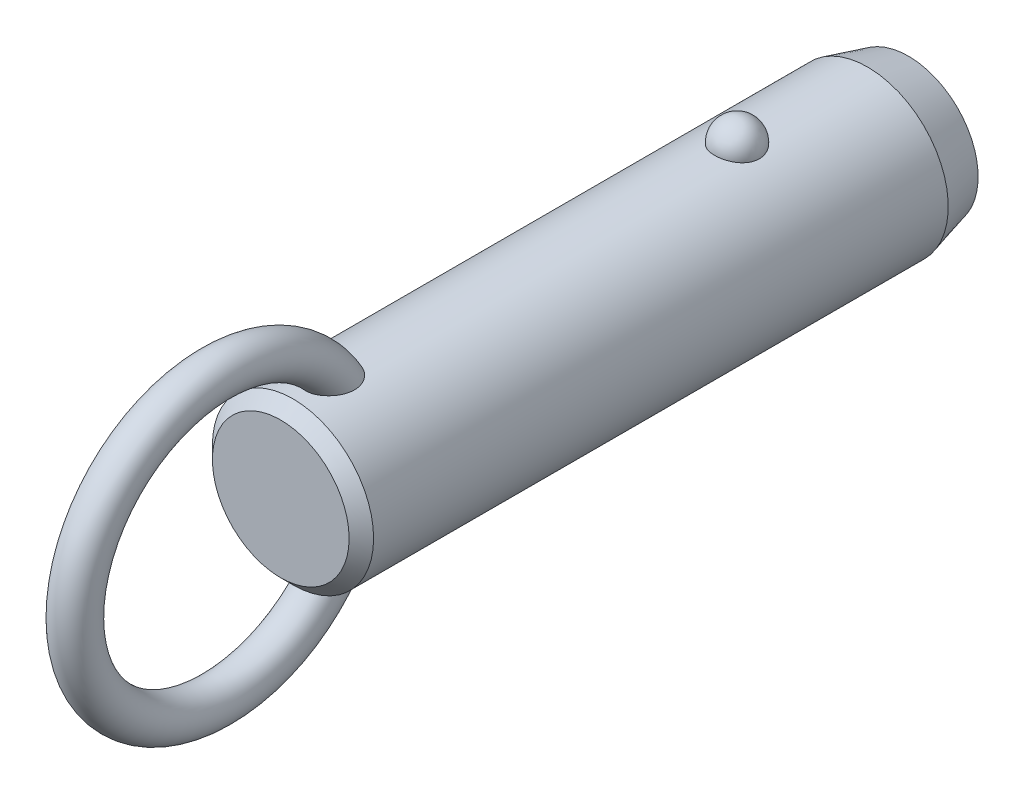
ISO-10303-21;
HEADER;
FILE_DESCRIPTION(('STEP AP214'),'2;1');
FILE_NAME('part.step','',(''),(''),'','','');
FILE_SCHEMA(('AUTOMOTIVE_DESIGN { 1 0 10303 214 1 1 1 1 }'));
ENDSEC;
DATA;
#1=APPLICATION_CONTEXT('core data for automotive mechanical design processes');
#2=APPLICATION_PROTOCOL_DEFINITION('international standard','automotive_design',2000,#1);
#3=PRODUCT_CONTEXT('',#1,'mechanical');
#4=PRODUCT('Part','Part','',(#3));
#5=PRODUCT_RELATED_PRODUCT_CATEGORY('part','',(#4));
#6=PRODUCT_DEFINITION_FORMATION('','',#4);
#7=PRODUCT_DEFINITION_CONTEXT('part definition',#1,'design');
#8=PRODUCT_DEFINITION('design','',#6,#7);
#9=PRODUCT_DEFINITION_SHAPE('','',#8);
#10=(LENGTH_UNIT() NAMED_UNIT(*) SI_UNIT(.MILLI.,.METRE.));
#11=(NAMED_UNIT(*) PLANE_ANGLE_UNIT() SI_UNIT($,.RADIAN.));
#12=(NAMED_UNIT(*) SI_UNIT($,.STERADIAN.) SOLID_ANGLE_UNIT());
#13=UNCERTAINTY_MEASURE_WITH_UNIT(LENGTH_MEASURE(1.E-05),#10,'distance_accuracy_value','');
#14=(GEOMETRIC_REPRESENTATION_CONTEXT(3) GLOBAL_UNCERTAINTY_ASSIGNED_CONTEXT((#13)) GLOBAL_UNIT_ASSIGNED_CONTEXT((#10,
#11,#12)) REPRESENTATION_CONTEXT('',''));
#15=CARTESIAN_POINT('',(0.,0.,0.));
#16=DIRECTION('',(0.,0.,1.));
#17=DIRECTION('',(1.,0.,0.));
#18=AXIS2_PLACEMENT_3D('',#15,#16,#17);
#19=CARTESIAN_POINT('',(0.,0.,33.));
#20=DIRECTION('',(0.,0.,-1.));
#21=DIRECTION('',(-1.,0.,0.));
#22=AXIS2_PLACEMENT_3D('',#19,#20,#21);
#23=CYLINDRICAL_SURFACE('',#22,7.9);
#24=CARTESIAN_POINT('',(2.1785689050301,7.59367088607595,-2.20000000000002));
#25=CARTESIAN_POINT('',(2.17856679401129,7.59367269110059,-2.07701843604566));
#26=CARTESIAN_POINT('',(2.16853481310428,7.59657145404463,-1.95401006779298));
#27=CARTESIAN_POINT('',(2.12864689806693,7.607843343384,-1.71147811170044));
#28=CARTESIAN_POINT('',(2.09878338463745,7.61621856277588,-1.5919558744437));
#29=CARTESIAN_POINT('',(2.0199931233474,7.63749180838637,-1.35985638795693));
#30=CARTESIAN_POINT('',(1.97107475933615,7.6503878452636,-1.24727610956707));
#31=CARTESIAN_POINT('',(1.85539377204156,7.67926115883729,-1.03213234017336));
#32=CARTESIAN_POINT('',(1.78863158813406,7.69523835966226,-0.929568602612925));
#33=CARTESIAN_POINT('',(1.63856494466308,7.7285848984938,-0.73678633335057));
#34=CARTESIAN_POINT('',(1.55518140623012,7.7459606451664,-0.646630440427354));
#35=CARTESIAN_POINT('',(1.37422937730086,7.78009978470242,-0.481747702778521));
#36=CARTESIAN_POINT('',(1.27666086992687,7.79686317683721,-0.407020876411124));
#37=CARTESIAN_POINT('',(1.07024728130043,7.82786153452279,-0.275278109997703));
#38=CARTESIAN_POINT('',(0.961434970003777,7.84210353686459,-0.218212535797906));
#39=CARTESIAN_POINT('',(0.735351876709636,7.86652194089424,-0.123146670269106));
#40=CARTESIAN_POINT('',(0.618082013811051,7.87669878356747,-0.0851443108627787));
#41=CARTESIAN_POINT('',(0.380637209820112,7.89170521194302,-0.0298158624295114));
#42=CARTESIAN_POINT('',(0.260550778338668,7.89662650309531,-0.0121347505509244));
#43=CARTESIAN_POINT('',(0.0190117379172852,7.90090003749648,0.00324379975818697));
#44=CARTESIAN_POINT('',(-0.102440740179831,7.90025280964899,0.000943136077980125));
#45=CARTESIAN_POINT('',(-0.341452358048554,7.89351056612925,-0.0233955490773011));
#46=CARTESIAN_POINT('',(-0.459042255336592,7.88749257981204,-0.0451545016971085));
#47=CARTESIAN_POINT('',(-0.688796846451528,7.87075812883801,-0.107408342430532));
#48=CARTESIAN_POINT('',(-0.800961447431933,7.86004158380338,-0.14790355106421));
#49=CARTESIAN_POINT('',(-1.01743634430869,7.83497131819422,-0.246799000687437));
#50=CARTESIAN_POINT('',(-1.12169791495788,7.82059709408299,-0.305300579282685));
#51=CARTESIAN_POINT('',(-1.31891765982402,7.78976470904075,-0.43854939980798));
#52=CARTESIAN_POINT('',(-1.41187469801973,7.77330633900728,-0.513298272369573));
#53=CARTESIAN_POINT('',(-1.58577142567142,7.73972434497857,-0.678622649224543));
#54=CARTESIAN_POINT('',(-1.66645140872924,7.72259402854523,-0.769470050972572));
#55=CARTESIAN_POINT('',(-1.81161503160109,7.68983776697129,-0.963538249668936));
#56=CARTESIAN_POINT('',(-1.87609753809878,7.6742119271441,-1.0667599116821));
#57=CARTESIAN_POINT('',(-1.98790138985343,7.6460202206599,-1.28401170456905));
#58=CARTESIAN_POINT('',(-2.03501994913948,7.63349104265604,-1.39815107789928));
#59=CARTESIAN_POINT('',(-2.10986724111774,7.6131449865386,-1.6330178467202));
#60=CARTESIAN_POINT('',(-2.1375965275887,7.60532797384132,-1.75374505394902));
#61=CARTESIAN_POINT('',(-2.17289256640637,7.5953195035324,-1.99782562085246));
#62=CARTESIAN_POINT('',(-2.18054294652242,7.59310471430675,-2.12116592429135));
#63=CARTESIAN_POINT('',(-2.17572919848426,7.59448538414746,-2.36741799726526));
#64=CARTESIAN_POINT('',(-2.1632656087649,7.59808068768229,-2.49032977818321));
#65=CARTESIAN_POINT('',(-2.11865035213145,7.61064035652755,-2.73161015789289));
#66=CARTESIAN_POINT('',(-2.08659579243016,7.61957823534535,-2.84999812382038));
#67=CARTESIAN_POINT('',(-2.00367799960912,7.64179982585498,-3.07955956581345));
#68=CARTESIAN_POINT('',(-1.9528140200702,7.65508371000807,-3.19073275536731));
#69=CARTESIAN_POINT('',(-1.83321113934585,7.68460381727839,-3.40337899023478));
#70=CARTESIAN_POINT('',(-1.76437735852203,7.70085556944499,-3.5047965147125));
#71=CARTESIAN_POINT('',(-1.61069526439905,7.73445734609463,-3.69446912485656));
#72=CARTESIAN_POINT('',(-1.52584634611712,7.75180741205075,-3.78272371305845));
#73=CARTESIAN_POINT('',(-1.34198059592,7.78574608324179,-3.94393987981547));
#74=CARTESIAN_POINT('',(-1.24291308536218,7.80233167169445,-4.01684434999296));
#75=CARTESIAN_POINT('',(-1.03352039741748,7.83281625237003,-4.14489386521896));
#76=CARTESIAN_POINT('',(-0.92319600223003,7.84671543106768,-4.20004014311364));
#77=CARTESIAN_POINT('',(-0.695822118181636,7.87011575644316,-4.29042017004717));
#78=CARTESIAN_POINT('',(-0.578872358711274,7.87966903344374,-4.32589112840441));
#79=CARTESIAN_POINT('',(-0.340410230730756,7.8935652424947,-4.37692226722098));
#80=CARTESIAN_POINT('',(-0.218898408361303,7.89790879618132,-4.39248482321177));
#81=CARTESIAN_POINT('',(0.0228107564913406,7.90087453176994,-4.40314405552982));
#82=CARTESIAN_POINT('',(0.142990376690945,7.89960185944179,-4.39861683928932));
#83=CARTESIAN_POINT('',(0.380829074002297,7.89171262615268,-4.37008293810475));
#84=CARTESIAN_POINT('',(0.498488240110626,7.8850962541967,-4.34607694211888));
#85=CARTESIAN_POINT('',(0.727535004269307,7.86726442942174,-4.27939317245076));
#86=CARTESIAN_POINT('',(0.838944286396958,7.85606616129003,-4.23678512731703));
#87=CARTESIAN_POINT('',(1.05295421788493,7.83025654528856,-4.13408348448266));
#88=CARTESIAN_POINT('',(1.15555431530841,7.81564498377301,-4.07398879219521));
#89=CARTESIAN_POINT('',(1.35076763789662,7.7843022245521,-3.93687432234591));
#90=CARTESIAN_POINT('',(1.4432046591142,7.76754209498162,-3.85961036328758));
#91=CARTESIAN_POINT('',(1.6139111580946,7.73387857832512,-3.69076949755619));
#92=CARTESIAN_POINT('',(1.6921781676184,7.71697516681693,-3.59919010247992));
#93=CARTESIAN_POINT('',(1.83380875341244,7.6845643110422,-3.40247278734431));
#94=CARTESIAN_POINT('',(1.89689280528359,7.66908588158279,-3.29712873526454));
#95=CARTESIAN_POINT('',(2.0047823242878,7.64159441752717,-3.07707931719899));
#96=CARTESIAN_POINT('',(2.0495945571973,7.62958010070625,-2.96237743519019));
#97=CARTESIAN_POINT('',(2.11580183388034,7.61146617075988,-2.74040519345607));
#98=CARTESIAN_POINT('',(2.13929812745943,7.60484503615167,-2.63379846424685));
#99=CARTESIAN_POINT('',(2.17068242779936,7.59594664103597,-2.4181348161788));
#100=CARTESIAN_POINT('',(2.17857077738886,7.59366928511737,-2.30907795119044));
#101=CARTESIAN_POINT('',(2.1785689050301,7.59367088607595,-2.20000000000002));
#102=B_SPLINE_CURVE_WITH_KNOTS('',3,(#24,#25,#26,#27,#28,#29,#30,#31,#32,#33,#34,#35,#36,#37,
#38,#39,#40,#41,#42,#43,#44,#45,#46,#47,#48,#49,#50,#51,#52,#53,#54,#55,#56,#57,#58,#59,#60,#61,
#62,#63,#64,#65,#66,#67,#68,#69,#70,#71,#72,#73,#74,#75,#76,#77,#78,#79,#80,#81,#82,#83,#84,#85,
#86,#87,#88,#89,#90,#91,#92,#93,#94,#95,#96,#97,#98,#99,#100,#101),.UNSPECIFIED.,.T.,.F.,(4,2,2,
2,2,2,2,2,2,2,2,2,2,2,2,2,2,2,2,2,2,2,2,2,2,2,2,2,2,2,2,2,2,2,2,2,2,2,4),(0.,0.368552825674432,
0.737246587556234,1.10577831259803,1.4743009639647,1.8446206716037,2.21494081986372,
2.5842105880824,2.95344028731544,3.31611630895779,3.67875788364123,4.03628044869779,
4.39380913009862,4.75338791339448,5.11300280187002,5.47939989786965,5.8458226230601,
6.21639834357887,6.58696347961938,6.95598276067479,7.32499216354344,7.69218715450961,
8.0593967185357,8.42858578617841,8.79778880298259,9.16834203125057,9.5388695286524,
9.90482699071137,10.2707407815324,10.6298333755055,10.9889132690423,11.3466585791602,
11.7044262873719,12.0676511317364,12.4309391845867,12.8004764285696,13.1698767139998,
13.4967701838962,13.8236564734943),.UNSPECIFIED.);
#103=CARTESIAN_POINT('',(2.1785689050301,7.59367088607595,-2.20000000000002));
#104=VERTEX_POINT('',#103);
#105=EDGE_CURVE('E41',#104,#104,#102,.T.);
#106=ORIENTED_EDGE('',*,*,#105,.T.);
#107=EDGE_LOOP('',(#106));
#108=FACE_BOUND('',#107,.T.);
#109=CARTESIAN_POINT('',(0.,0.,41.32));
#110=DIRECTION('',(0.,0.,1.));
#111=DIRECTION('',(1.,0.,0.));
#112=AXIS2_PLACEMENT_3D('',#109,#110,#111);
#113=CIRCLE('',#112,7.9);
#114=CARTESIAN_POINT('',(7.9,0.,41.32));
#115=VERTEX_POINT('',#114);
#116=EDGE_CURVE('E10',#115,#115,#113,.F.);
#117=ORIENTED_EDGE('',*,*,#116,.T.);
#118=EDGE_LOOP('',(#117));
#119=FACE_BOUND('',#118,.T.);
#120=CARTESIAN_POINT('',(-0.630969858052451,-7.87476203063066,35.2124322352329));
#121=CARTESIAN_POINT('',(-0.734180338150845,-7.86648998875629,35.2472854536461));
#122=CARTESIAN_POINT('',(-0.834476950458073,-7.85639291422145,35.2908160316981));
#123=CARTESIAN_POINT('',(-1.0262035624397,-7.83366343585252,35.3940948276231));
#124=CARTESIAN_POINT('',(-1.1176141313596,-7.82102565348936,35.4538775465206));
#125=CARTESIAN_POINT('',(-1.28877277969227,-7.79464922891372,35.5878390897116));
#126=CARTESIAN_POINT('',(-1.36854014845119,-7.78091246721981,35.661993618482));
#127=CARTESIAN_POINT('',(-1.51461521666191,-7.75380398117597,35.8224941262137));
#128=CARTESIAN_POINT('',(-1.58092966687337,-7.74043207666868,35.9088339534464));
#129=CARTESIAN_POINT('',(-1.70019064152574,-7.7151252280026,36.0929784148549));
#130=CARTESIAN_POINT('',(-1.75284037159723,-7.70322473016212,36.1909792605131));
#131=CARTESIAN_POINT('',(-1.84263464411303,-7.68224112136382,36.3941029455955));
#132=CARTESIAN_POINT('',(-1.87977299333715,-7.6731591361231,36.4992286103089));
#133=CARTESIAN_POINT('',(-1.94152728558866,-7.65777930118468,36.7232849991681));
#134=CARTESIAN_POINT('',(-1.96475471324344,-7.65179654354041,36.8426167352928));
#135=CARTESIAN_POINT('',(-1.99449499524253,-7.64409642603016,37.0834298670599));
#136=CARTESIAN_POINT('',(-2.0010005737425,-7.64238092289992,37.2049121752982));
#137=CARTESIAN_POINT('',(-1.99856014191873,-7.64302120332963,37.4683409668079));
#138=CARTESIAN_POINT('',(-1.98680021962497,-7.64611845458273,37.6102565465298));
#139=CARTESIAN_POINT('',(-1.94457772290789,-7.65696186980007,37.8911188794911));
#140=CARTESIAN_POINT('',(-1.91409393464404,-7.66471330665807,38.0300620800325));
#141=CARTESIAN_POINT('',(-1.82768670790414,-7.68582947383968,38.331939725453));
#142=CARTESIAN_POINT('',(-1.76772963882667,-7.70003779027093,38.493686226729));
#143=CARTESIAN_POINT('',(-1.65998501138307,-7.72371550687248,38.7276956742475));
#144=CARTESIAN_POINT('',(-1.62107967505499,-7.73200670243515,38.8042974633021));
#145=CARTESIAN_POINT('',(-1.53727726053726,-7.74910377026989,38.9540798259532));
#146=CARTESIAN_POINT('',(-1.4923821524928,-7.75790947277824,39.0272615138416));
#147=CARTESIAN_POINT('',(-1.37397050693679,-7.77993338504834,39.2028838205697));
#148=CARTESIAN_POINT('',(-1.29690364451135,-7.79328473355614,39.3029557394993));
#149=CARTESIAN_POINT('',(-1.12885487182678,-7.81939266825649,39.4907147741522));
#150=CARTESIAN_POINT('',(-1.03789926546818,-7.83215032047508,39.5784247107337));
#151=CARTESIAN_POINT('',(-0.869532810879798,-7.85231710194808,39.7134148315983));
#152=CARTESIAN_POINT('',(-0.795716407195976,-7.86021093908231,39.765076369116));
#153=CARTESIAN_POINT('',(-0.640813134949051,-7.87434920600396,39.8563815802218));
#154=CARTESIAN_POINT('',(-0.559737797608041,-7.88059619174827,39.8960438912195));
#155=CARTESIAN_POINT('',(-0.406456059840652,-7.88984116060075,39.9543008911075));
#156=CARTESIAN_POINT('',(-0.335227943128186,-7.89321892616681,39.9753848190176));
#157=CARTESIAN_POINT('',(-0.190193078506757,-7.89804235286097,40.0054141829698));
#158=CARTESIAN_POINT('',(-0.116388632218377,-7.89948969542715,40.0143701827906));
#159=CARTESIAN_POINT('',(0.0318414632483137,-7.90028409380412,40.0192915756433));
#160=CARTESIAN_POINT('',(0.106268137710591,-7.89962640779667,40.0152276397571));
#161=CARTESIAN_POINT('',(0.253290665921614,-7.8962818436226,39.9944615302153));
#162=CARTESIAN_POINT('',(0.325885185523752,-7.8935935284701,39.9777504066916));
#163=CARTESIAN_POINT('',(0.481441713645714,-7.88577340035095,39.9287380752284));
#164=CARTESIAN_POINT('',(0.563611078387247,-7.88026321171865,39.894005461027));
#165=CARTESIAN_POINT('',(0.721129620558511,-7.86741729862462,39.8117965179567));
#166=CARTESIAN_POINT('',(0.796466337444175,-7.86007832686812,39.7642975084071));
#167=CARTESIAN_POINT('',(0.971456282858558,-7.84073285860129,39.636513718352));
#168=CARTESIAN_POINT('',(1.06719686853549,-7.82809461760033,39.5510047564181));
#169=CARTESIAN_POINT('',(1.24418921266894,-7.80192439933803,39.366232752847));
#170=CARTESIAN_POINT('',(1.32540832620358,-7.78839049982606,39.2669395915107));
#171=CARTESIAN_POINT('',(1.45199971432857,-7.76559693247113,39.0895760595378));
#172=CARTESIAN_POINT('',(1.5008564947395,-7.75626094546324,39.0139542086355));
#173=CARTESIAN_POINT('',(1.59197749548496,-7.7380727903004,38.8587428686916));
#174=CARTESIAN_POINT('',(1.63423919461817,-7.72922080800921,38.7791518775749));
#175=CARTESIAN_POINT('',(1.71222612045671,-7.71231959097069,38.6166640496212));
#176=CARTESIAN_POINT('',(1.74794516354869,-7.70427111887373,38.533764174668));
#177=CARTESIAN_POINT('',(1.81270113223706,-7.68929240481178,38.3652967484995));
#178=CARTESIAN_POINT('',(1.84173789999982,-7.68236218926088,38.2797291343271));
#179=CARTESIAN_POINT('',(1.89322698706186,-7.6698375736,38.1052870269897));
#180=CARTESIAN_POINT('',(1.91558744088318,-7.66426199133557,38.0163838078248));
#181=CARTESIAN_POINT('',(1.95281367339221,-7.65485915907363,37.8369696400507));
#182=CARTESIAN_POINT('',(1.96767946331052,-7.65103190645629,37.7464586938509));
#183=CARTESIAN_POINT('',(2.00021456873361,-7.64262981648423,37.4737320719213));
#184=CARTESIAN_POINT('',(2.00600691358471,-7.6410871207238,37.2897099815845));
#185=CARTESIAN_POINT('',(1.98445334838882,-7.64669564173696,36.9765019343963));
#186=CARTESIAN_POINT('',(1.96607186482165,-7.65149688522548,36.846618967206));
#187=CARTESIAN_POINT('',(1.90884967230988,-7.6659762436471,36.5916321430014));
#188=CARTESIAN_POINT('',(1.87002101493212,-7.67565148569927,36.466525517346));
#189=CARTESIAN_POINT('',(1.77063986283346,-7.69918471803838,36.2245401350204));
#190=CARTESIAN_POINT('',(1.70993724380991,-7.71307150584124,36.1077250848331));
#191=CARTESIAN_POINT('',(1.56733070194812,-7.74330306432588,35.8881444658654));
#192=CARTESIAN_POINT('',(1.48543692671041,-7.75964665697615,35.7853722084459));
#193=CARTESIAN_POINT('',(1.31346177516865,-7.79047523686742,35.6093800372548));
#194=CARTESIAN_POINT('',(1.22547278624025,-7.80495298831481,35.5341066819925));
#195=CARTESIAN_POINT('',(1.03724352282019,-7.83218597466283,35.4004864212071));
#196=CARTESIAN_POINT('',(0.937008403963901,-7.84494192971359,35.3421324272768));
#197=CARTESIAN_POINT('',(0.73359933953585,-7.86649045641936,35.2470270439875));
#198=CARTESIAN_POINT('',(0.630941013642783,-7.87547134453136,35.2092109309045));
#199=CARTESIAN_POINT('',(0.420465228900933,-7.88950708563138,35.1511160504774));
#200=CARTESIAN_POINT('',(0.31264590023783,-7.89456050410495,35.1308436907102));
#201=CARTESIAN_POINT('',(0.0960869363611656,-7.9001518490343,35.1084559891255));
#202=CARTESIAN_POINT('',(-0.012634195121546,-7.90073226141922,35.1061698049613));
#203=CARTESIAN_POINT('',(-0.228766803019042,-7.89742350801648,35.1193678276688));
#204=CARTESIAN_POINT('',(-0.336180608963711,-7.89354403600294,35.1348134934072));
#205=CARTESIAN_POINT('',(-0.473410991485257,-7.88586871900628,35.1662177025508));
#206=CARTESIAN_POINT('',(-0.505257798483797,-7.88388984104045,35.1743541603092));
#207=CARTESIAN_POINT('',(-0.568481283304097,-7.87958326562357,35.1922083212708));
#208=CARTESIAN_POINT('',(-0.599857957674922,-7.87725556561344,35.2019260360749));
#209=CARTESIAN_POINT('',(-0.630969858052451,-7.87476203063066,35.2124322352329));
#210=B_SPLINE_CURVE_WITH_KNOTS('',3,(#120,#121,#122,#123,#124,#125,#126,#127,#128,#129,#130,
#131,#132,#133,#134,#135,#136,#137,#138,#139,#140,#141,#142,#143,#144,#145,#146,#147,#148,#149,
#150,#151,#152,#153,#154,#155,#156,#157,#158,#159,#160,#161,#162,#163,#164,#165,#166,#167,#168,
#169,#170,#171,#172,#173,#174,#175,#176,#177,#178,#179,#180,#181,#182,#183,#184,#185,#186,#187,
#188,#189,#190,#191,#192,#193,#194,#195,#196,#197,#198,#199,#200,#201,#202,#203,#204,#205,#206,
#207,#208,#209),.UNSPECIFIED.,.T.,.F.,(4,2,2,2,2,2,2,2,2,2,2,2,2,2,2,2,2,2,2,2,2,2,2,2,2,2,2,2,
2,2,2,2,2,2,2,2,2,2,2,2,2,2,2,2,4),(0.,0.327622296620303,0.65594559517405,0.983718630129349,
1.3113267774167,1.64554655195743,1.97989964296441,2.34365728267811,2.70757317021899,
3.13333684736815,3.55958380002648,4.07655306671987,4.33527897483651,4.593919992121,
4.97382437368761,5.35301797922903,5.62348245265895,5.89352465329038,6.11565959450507,
6.3376009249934,6.56004255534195,6.782641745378,7.04930844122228,7.31645206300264,
7.70130871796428,8.08701995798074,8.35824509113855,8.62957365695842,8.90115735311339,
9.17274746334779,9.447918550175,9.7230892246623,10.2715298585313,10.6638393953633,
11.0559179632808,11.4507403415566,11.8453740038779,12.1936425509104,12.5417649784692,
12.8695063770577,13.1973674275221,13.5221104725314,13.8461490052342,13.9449071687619,
14.0436660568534),.UNSPECIFIED.);
#211=CARTESIAN_POINT('',(-0.630969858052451,-7.87476203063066,35.2124322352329));
#212=VERTEX_POINT('',#211);
#213=EDGE_CURVE('E59',#212,#212,#210,.T.);
#214=ORIENTED_EDGE('',*,*,#213,.T.);
#215=EDGE_LOOP('',(#214));
#216=FACE_BOUND('',#215,.T.);
#217=CARTESIAN_POINT('',(-0.630969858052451,7.87476203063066,35.2124322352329));
#218=CARTESIAN_POINT('',(-0.528918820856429,7.88293636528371,35.1779798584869));
#219=CARTESIAN_POINT('',(-0.423745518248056,7.88934810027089,35.151915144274));
#220=CARTESIAN_POINT('',(-0.210236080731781,7.8979273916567,35.1172825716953));
#221=CARTESIAN_POINT('',(-0.101893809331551,7.90008607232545,35.1087513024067));
#222=CARTESIAN_POINT('',(0.114660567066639,7.89990877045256,35.1094570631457));
#223=CARTESIAN_POINT('',(0.222872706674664,7.89757640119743,35.1186798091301));
#224=CARTESIAN_POINT('',(0.436107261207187,7.88867538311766,35.1546525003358));
#225=CARTESIAN_POINT('',(0.541131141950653,7.8821087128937,35.1813942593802));
#226=CARTESIAN_POINT('',(0.745085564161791,7.86545130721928,35.2517561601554));
#227=CARTESIAN_POINT('',(0.844015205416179,7.85536005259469,35.2953787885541));
#228=CARTESIAN_POINT('',(1.03299167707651,7.83275153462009,35.3983796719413));
#229=CARTESIAN_POINT('',(1.12303841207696,7.8202342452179,35.4577580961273));
#230=CARTESIAN_POINT('',(1.29214734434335,7.79408219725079,35.5908647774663));
#231=CARTESIAN_POINT('',(1.37116907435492,7.78044359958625,35.6646436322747));
#232=CARTESIAN_POINT('',(1.51597677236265,7.75353170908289,35.8242353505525));
#233=CARTESIAN_POINT('',(1.58176261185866,7.74025841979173,35.9100483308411));
#234=CARTESIAN_POINT('',(1.70057386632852,7.71504069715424,36.093644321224));
#235=CARTESIAN_POINT('',(1.75320073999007,7.7031425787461,36.1916906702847));
#236=CARTESIAN_POINT('',(1.84293767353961,7.68216822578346,36.3948931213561));
#237=CARTESIAN_POINT('',(1.88004278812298,7.67309289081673,36.5000514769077));
#238=CARTESIAN_POINT('',(1.9417232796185,7.6577294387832,36.7241671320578));
#239=CARTESIAN_POINT('',(1.96491037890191,7.65175648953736,36.8435248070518));
#240=CARTESIAN_POINT('',(1.9945689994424,7.64407702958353,37.0843848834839));
#241=CARTESIAN_POINT('',(2.00103304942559,7.64237242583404,37.2058882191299));
#242=CARTESIAN_POINT('',(1.99850166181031,7.64303650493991,37.4693688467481));
#243=CARTESIAN_POINT('',(1.98669038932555,7.64614714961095,37.6113141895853));
#244=CARTESIAN_POINT('',(1.94436120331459,7.6570170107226,37.8922287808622));
#245=CARTESIAN_POINT('',(1.91382203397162,7.66478150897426,38.0311944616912));
#246=CARTESIAN_POINT('',(1.82728754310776,7.68592483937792,38.3331110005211));
#247=CARTESIAN_POINT('',(1.76725778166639,7.7001468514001,38.4948721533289));
#248=CARTESIAN_POINT('',(1.65939700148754,7.72384204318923,38.7288914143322));
#249=CARTESIAN_POINT('',(1.62045187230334,7.73213852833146,38.8054942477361));
#250=CARTESIAN_POINT('',(1.53656684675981,7.74924489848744,38.9552737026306));
#251=CARTESIAN_POINT('',(1.49162892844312,7.75805461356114,39.0284514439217));
#252=CARTESIAN_POINT('',(1.37317698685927,7.78007342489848,39.2039520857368));
#253=CARTESIAN_POINT('',(1.29612360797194,7.79341423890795,39.3039112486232));
#254=CARTESIAN_POINT('',(1.12812043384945,7.81949839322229,39.4914508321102));
#255=CARTESIAN_POINT('',(1.03719688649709,7.83224280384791,39.5790540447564));
#256=CARTESIAN_POINT('',(0.868871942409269,7.85239026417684,39.7138971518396));
#257=CARTESIAN_POINT('',(0.79505627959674,7.86027769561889,39.7655113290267));
#258=CARTESIAN_POINT('',(0.640160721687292,7.87440222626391,39.8567201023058));
#259=CARTESIAN_POINT('',(0.559092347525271,7.88064188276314,39.8963333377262));
#260=CARTESIAN_POINT('',(0.405820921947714,7.8898738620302,39.9545056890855));
#261=CARTESIAN_POINT('',(0.334594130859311,7.89324577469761,39.9755523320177));
#262=CARTESIAN_POINT('',(0.189568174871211,7.89805733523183,40.0055070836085));
#263=CARTESIAN_POINT('',(0.11577130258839,7.89949866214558,40.0144257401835));
#264=CARTESIAN_POINT('',(-0.032435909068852,7.90028156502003,40.0192758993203));
#265=CARTESIAN_POINT('',(-0.106847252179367,7.89961843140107,40.0151782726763));
#266=CARTESIAN_POINT('',(-0.253834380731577,7.8962642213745,39.9943519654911));
#267=CARTESIAN_POINT('',(-0.326408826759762,7.89357170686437,39.9776143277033));
#268=CARTESIAN_POINT('',(-0.481962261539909,7.88574179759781,39.9285391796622));
#269=CARTESIAN_POINT('',(-0.564145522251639,7.88022507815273,39.8937638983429));
#270=CARTESIAN_POINT('',(-0.721685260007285,7.8673664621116,39.8114686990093));
#271=CARTESIAN_POINT('',(-0.797029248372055,7.8600213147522,39.7639260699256));
#272=CARTESIAN_POINT('',(-0.972044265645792,7.84066026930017,39.6360267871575));
#273=CARTESIAN_POINT('',(-1.06779803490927,7.82801274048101,39.5504436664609));
#274=CARTESIAN_POINT('',(-1.24480531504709,7.80182621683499,39.3655223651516));
#275=CARTESIAN_POINT('',(-1.3260261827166,7.78828530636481,39.2661540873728));
#276=CARTESIAN_POINT('',(-1.45259834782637,7.76548487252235,39.0886806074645));
#277=CARTESIAN_POINT('',(-1.50143856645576,7.75614818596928,39.0130252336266));
#278=CARTESIAN_POINT('',(-1.59252410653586,7.73796020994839,38.8577484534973));
#279=CARTESIAN_POINT('',(-1.63476690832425,7.72910910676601,38.7781255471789));
#280=CARTESIAN_POINT('',(-1.71271318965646,7.71221133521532,38.6155750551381));
#281=CARTESIAN_POINT('',(-1.74841047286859,7.70416543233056,38.5326444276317));
#282=CARTESIAN_POINT('',(-1.81311929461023,7.6891937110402,38.3641168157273));
#283=CARTESIAN_POINT('',(-1.84213067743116,7.6822679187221,38.2785197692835));
#284=CARTESIAN_POINT('',(-1.89356259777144,7.66975461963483,38.1040254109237));
#285=CARTESIAN_POINT('',(-1.91589165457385,7.66418586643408,38.0150995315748));
#286=CARTESIAN_POINT('',(-1.95305070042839,7.65479859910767,37.8356424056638));
#287=CARTESIAN_POINT('',(-1.96788069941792,7.65098008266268,37.7451111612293));
#288=CARTESIAN_POINT('',(-2.00030078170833,7.64260704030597,37.4723270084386));
#289=CARTESIAN_POINT('',(-2.00600576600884,7.64108760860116,37.2882718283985));
#290=CARTESIAN_POINT('',(-1.98428483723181,7.64673945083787,36.9750800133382));
#291=CARTESIAN_POINT('',(-1.96583698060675,7.6515575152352,36.8452400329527));
#292=CARTESIAN_POINT('',(-1.90848948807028,7.66606613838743,36.5903619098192));
#293=CARTESIAN_POINT('',(-1.86960376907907,7.67575338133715,36.465320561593));
#294=CARTESIAN_POINT('',(-1.7701342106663,7.6993013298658,36.2235009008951));
#295=CARTESIAN_POINT('',(-1.70940488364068,7.71318991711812,36.1067844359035));
#296=CARTESIAN_POINT('',(-1.56672953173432,7.74342495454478,35.8873404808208));
#297=CARTESIAN_POINT('',(-1.48478316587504,7.75977144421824,35.7846132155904));
#298=CARTESIAN_POINT('',(-1.31266325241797,7.79061163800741,35.608643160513));
#299=CARTESIAN_POINT('',(-1.22456383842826,7.80509908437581,35.5333589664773));
#300=CARTESIAN_POINT('',(-1.03622400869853,7.83231881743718,35.3998659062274));
#301=CARTESIAN_POINT('',(-0.936015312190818,7.84505551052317,35.3416137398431));
#302=CARTESIAN_POINT('',(-0.798824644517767,7.85957802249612,35.2775408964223));
#303=CARTESIAN_POINT('',(-0.765787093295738,7.86286821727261,35.2632248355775));
#304=CARTESIAN_POINT('',(-0.698939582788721,7.86909211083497,35.236436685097));
#305=CARTESIAN_POINT('',(-0.665129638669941,7.8720258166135,35.2239645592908));
#306=CARTESIAN_POINT('',(-0.630969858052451,7.87476203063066,35.2124322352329));
#307=B_SPLINE_CURVE_WITH_KNOTS('',3,(#217,#218,#219,#220,#221,#222,#223,#224,#225,#226,#227,
#228,#229,#230,#231,#232,#233,#234,#235,#236,#237,#238,#239,#240,#241,#242,#243,#244,#245,#246,
#247,#248,#249,#250,#251,#252,#253,#254,#255,#256,#257,#258,#259,#260,#261,#262,#263,#264,#265,
#266,#267,#268,#269,#270,#271,#272,#273,#274,#275,#276,#277,#278,#279,#280,#281,#282,#283,#284,
#285,#286,#287,#288,#289,#290,#291,#292,#293,#294,#295,#296,#297,#298,#299,#300,#301,#302,#303,
#304,#305,#306),.UNSPECIFIED.,.T.,.F.,(4,2,2,2,2,2,2,2,2,2,2,2,2,2,2,2,2,2,2,2,2,2,2,2,2,2,2,2,
2,2,2,2,2,2,2,2,2,2,2,2,2,2,2,2,4),(0.,0.323920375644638,0.648516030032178,0.972850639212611,
1.29703380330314,1.62126473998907,1.94549915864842,2.27089401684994,2.5962920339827,
2.93059633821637,3.26500707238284,3.6288164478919,3.99278833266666,4.41865421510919,
4.84500434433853,5.36209210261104,5.62087589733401,5.87957448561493,6.25918598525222,
6.63808782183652,6.90846748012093,7.17842501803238,7.40052350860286,7.62242871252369,
7.84483086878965,8.0673907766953,8.33414615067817,8.60137921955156,8.98641454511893,
9.37230415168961,9.64358673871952,9.91497268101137,10.1866142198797,10.4582620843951,
10.7334745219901,11.0086865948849,11.5572126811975,11.9494246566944,12.3413699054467,
12.7359755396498,13.1305875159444,13.4791770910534,13.82687259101,13.9353013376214,
14.0437279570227),.UNSPECIFIED.);
#308=CARTESIAN_POINT('',(-0.630969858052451,7.87476203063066,35.2124322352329));
#309=VERTEX_POINT('',#308);
#310=EDGE_CURVE('E67',#309,#309,#307,.T.);
#311=ORIENTED_EDGE('',*,*,#310,.T.);
#312=EDGE_LOOP('',(#311));
#313=FACE_BOUND('',#312,.T.);
#314=CARTESIAN_POINT('',(0.,0.,-14.9999999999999));
#315=DIRECTION('',(0.,0.,-1.));
#316=DIRECTION('',(-1.,0.,0.));
#317=AXIS2_PLACEMENT_3D('',#314,#315,#316);
#318=CIRCLE('',#317,7.9);
#319=CARTESIAN_POINT('',(-7.9,0.,-14.9999999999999));
#320=VERTEX_POINT('',#319);
#321=EDGE_CURVE('E56',#320,#320,#318,.F.);
#322=ORIENTED_EDGE('',*,*,#321,.T.);
#323=EDGE_LOOP('',(#322));
#324=FACE_BOUND('',#323,.T.);
#325=ADVANCED_FACE('F37',(#108,#119,#216,#313,#324),#23,.T.);
#326=CARTESIAN_POINT('',(0.,0.,-19.));
#327=DIRECTION('',(0.,0.,-1.));
#328=DIRECTION('',(-1.,0.,0.));
#329=AXIS2_PLACEMENT_3D('',#326,#327,#328);
#330=PLANE('',#329);
#331=CARTESIAN_POINT('',(0.,0.,-19.));
#332=DIRECTION('',(0.,0.,-1.));
#333=DIRECTION('',(-1.,0.,0.));
#334=AXIS2_PLACEMENT_3D('',#331,#332,#333);
#335=CIRCLE('',#334,6.82820323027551);
#336=CARTESIAN_POINT('',(-6.82820323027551,0.,-19.));
#337=VERTEX_POINT('',#336);
#338=EDGE_CURVE('E66',#337,#337,#335,.T.);
#339=ORIENTED_EDGE('',*,*,#338,.T.);
#340=EDGE_LOOP('',(#339));
#341=FACE_BOUND('',#340,.T.);
#342=ADVANCED_FACE('F85',(#341),#330,.T.);
#343=CARTESIAN_POINT('',(0.,0.,-19.));
#344=DIRECTION('',(0.,0.,1.));
#345=DIRECTION('',(1.,0.,0.));
#346=AXIS2_PLACEMENT_3D('',#343,#344,#345);
#347=CONICAL_SURFACE('',#346,6.82820323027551,0.261799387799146);
#348=ORIENTED_EDGE('',*,*,#321,.F.);
#349=EDGE_LOOP('',(#348));
#350=FACE_BOUND('',#349,.T.);
#351=ORIENTED_EDGE('',*,*,#338,.F.);
#352=EDGE_LOOP('',(#351));
#353=FACE_BOUND('',#352,.T.);
#354=ADVANCED_FACE('F83',(#350,#353),#347,.T.);
#355=CARTESIAN_POINT('',(0.,0.,42.52));
#356=DIRECTION('',(0.,0.,1.));
#357=DIRECTION('',(1.,0.,0.));
#358=AXIS2_PLACEMENT_3D('',#355,#356,#357);
#359=PLANE('',#358);
#360=CARTESIAN_POINT('',(0.,0.,42.52));
#361=DIRECTION('',(0.,0.,1.));
#362=DIRECTION('',(1.,0.,0.));
#363=AXIS2_PLACEMENT_3D('',#360,#361,#362);
#364=CIRCLE('',#363,6.7);
#365=CARTESIAN_POINT('',(6.7,0.,42.52));
#366=VERTEX_POINT('',#365);
#367=EDGE_CURVE('E50',#366,#366,#364,.T.);
#368=ORIENTED_EDGE('',*,*,#367,.T.);
#369=EDGE_LOOP('',(#368));
#370=FACE_BOUND('',#369,.T.);
#371=ADVANCED_FACE('F77',(#370),#359,.T.);
#372=CARTESIAN_POINT('',(0.,0.,48.85));
#373=DIRECTION('',(1.,0.,0.));
#374=DIRECTION('',(0.,0.,-1.));
#375=AXIS2_PLACEMENT_3D('',#372,#373,#374);
#376=TOROIDAL_SURFACE('',#375,13.85,2.);
#377=ORIENTED_EDGE('',*,*,#310,.F.);
#378=EDGE_LOOP('',(#377));
#379=FACE_BOUND('',#378,.T.);
#380=ORIENTED_EDGE('',*,*,#213,.F.);
#381=EDGE_LOOP('',(#380));
#382=FACE_BOUND('',#381,.T.);
#383=ADVANCED_FACE('F73',(#379,#382),#376,.T.);
#384=CARTESIAN_POINT('',(0.,0.,42.52));
#385=DIRECTION('',(0.,0.,-1.));
#386=DIRECTION('',(-1.,0.,0.));
#387=AXIS2_PLACEMENT_3D('',#384,#385,#386);
#388=CONICAL_SURFACE('',#387,6.7,0.785398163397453);
#389=ORIENTED_EDGE('',*,*,#116,.F.);
#390=EDGE_LOOP('',(#389));
#391=FACE_BOUND('',#390,.T.);
#392=ORIENTED_EDGE('',*,*,#367,.F.);
#393=EDGE_LOOP('',(#392));
#394=FACE_BOUND('',#393,.T.);
#395=ADVANCED_FACE('F39',(#391,#394),#388,.T.);
#396=CARTESIAN_POINT('',(0.,7.9,-2.20000000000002));
#397=DIRECTION('',(0.,1.,0.));
#398=DIRECTION('',(0.,0.,1.));
#399=AXIS2_PLACEMENT_3D('',#396,#397,#398);
#400=SPHERICAL_SURFACE('',#399,2.2);
#401=ORIENTED_EDGE('',*,*,#105,.F.);
#402=EDGE_LOOP('',(#401));
#403=FACE_BOUND('',#402,.T.);
#404=ADVANCED_FACE('F79',(#403),#400,.T.);
#405=CLOSED_SHELL('',(#325,#342,#354,#371,#383,#395,#404));
#406=MANIFOLD_SOLID_BREP('B2',#405);
#407=ADVANCED_BREP_SHAPE_REPRESENTATION('',(#18,#406),#14);
#408=SHAPE_DEFINITION_REPRESENTATION(#9,#407);
ENDSEC;
END-ISO-10303-21;
